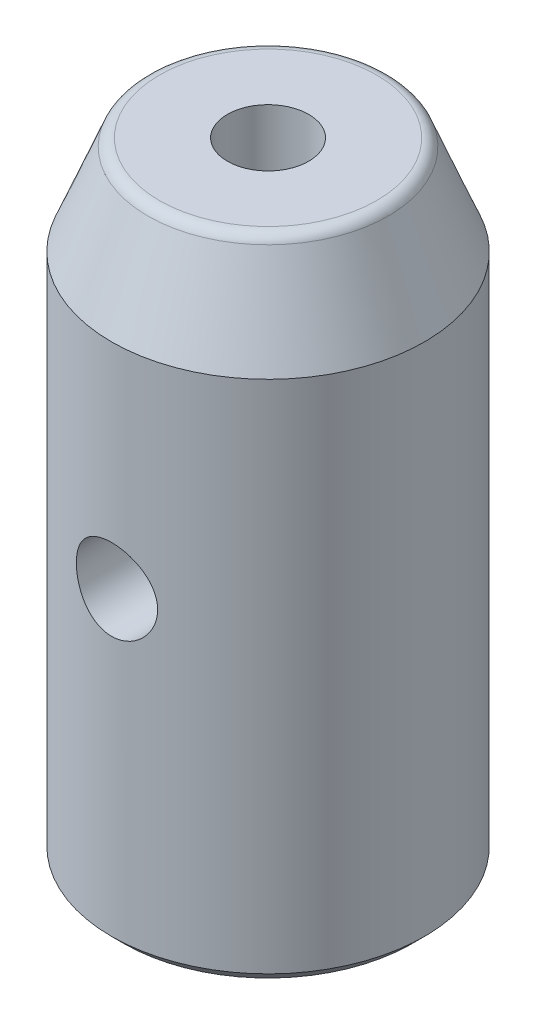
ISO-10303-21;
HEADER;
FILE_DESCRIPTION(('STEP AP214'),'2;1');
FILE_NAME('part.step','',(''),(''),'','','');
FILE_SCHEMA(('AUTOMOTIVE_DESIGN { 1 0 10303 214 1 1 1 1 }'));
ENDSEC;
DATA;
#1=APPLICATION_CONTEXT('core data for automotive mechanical design processes');
#2=APPLICATION_PROTOCOL_DEFINITION('international standard','automotive_design',2000,#1);
#3=PRODUCT_CONTEXT('',#1,'mechanical');
#4=PRODUCT('Part','Part','',(#3));
#5=PRODUCT_RELATED_PRODUCT_CATEGORY('part','',(#4));
#6=PRODUCT_DEFINITION_FORMATION('','',#4);
#7=PRODUCT_DEFINITION_CONTEXT('part definition',#1,'design');
#8=PRODUCT_DEFINITION('design','',#6,#7);
#9=PRODUCT_DEFINITION_SHAPE('','',#8);
#10=(LENGTH_UNIT() NAMED_UNIT(*) SI_UNIT(.MILLI.,.METRE.));
#11=(NAMED_UNIT(*) PLANE_ANGLE_UNIT() SI_UNIT($,.RADIAN.));
#12=(NAMED_UNIT(*) SI_UNIT($,.STERADIAN.) SOLID_ANGLE_UNIT());
#13=UNCERTAINTY_MEASURE_WITH_UNIT(LENGTH_MEASURE(1.E-05),#10,'distance_accuracy_value','');
#14=(GEOMETRIC_REPRESENTATION_CONTEXT(3) GLOBAL_UNCERTAINTY_ASSIGNED_CONTEXT((#13)) GLOBAL_UNIT_ASSIGNED_CONTEXT((#10,
#11,#12)) REPRESENTATION_CONTEXT('',''));
#15=CARTESIAN_POINT('',(0.,0.,0.));
#16=DIRECTION('',(0.,0.,1.));
#17=DIRECTION('',(1.,0.,0.));
#18=AXIS2_PLACEMENT_3D('',#15,#16,#17);
#19=CARTESIAN_POINT('',(0.,25.4,0.));
#20=DIRECTION('',(0.,-1.,0.));
#21=DIRECTION('',(0.,0.,-1.));
#22=AXIS2_PLACEMENT_3D('',#19,#20,#21);
#23=CYLINDRICAL_SURFACE('',#22,6.35);
#24=CARTESIAN_POINT('',(0.,14.35,-6.35));
#25=CARTESIAN_POINT('',(-0.0910448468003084,14.3499976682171,-6.34999855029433));
#26=CARTESIAN_POINT('',(-0.182115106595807,14.3424390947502,-6.34802256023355));
#27=CARTESIAN_POINT('',(-0.361637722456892,14.312454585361,-6.34033166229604));
#28=CARTESIAN_POINT('',(-0.450088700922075,14.290020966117,-6.33461482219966));
#29=CARTESIAN_POINT('',(-0.621755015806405,14.2310607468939,-6.32007407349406));
#30=CARTESIAN_POINT('',(-0.704976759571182,14.1945518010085,-6.3112540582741));
#31=CARTESIAN_POINT('',(-0.864115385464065,14.1085413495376,-6.29144207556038));
#32=CARTESIAN_POINT('',(-0.940031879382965,14.0590391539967,-6.28044999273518));
#33=CARTESIAN_POINT('',(-1.08408361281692,13.9472915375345,-6.25721162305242));
#34=CARTESIAN_POINT('',(-1.1520343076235,13.8848124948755,-6.2449447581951));
#35=CARTESIAN_POINT('',(-1.27662045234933,13.7493844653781,-6.22067339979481));
#36=CARTESIAN_POINT('',(-1.33325452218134,13.6764342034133,-6.20866893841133));
#37=CARTESIAN_POINT('',(-1.43448627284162,13.5206782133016,-6.18607236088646));
#38=CARTESIAN_POINT('',(-1.47887409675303,13.4377319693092,-6.17550627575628));
#39=CARTESIAN_POINT('',(-1.55300255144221,13.2652354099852,-6.15728432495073));
#40=CARTESIAN_POINT('',(-1.58274573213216,13.1756862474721,-6.14962795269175));
#41=CARTESIAN_POINT('',(-1.62610440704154,12.9945636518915,-6.13830437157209));
#42=CARTESIAN_POINT('',(-1.6400533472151,12.9030753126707,-6.13455482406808));
#43=CARTESIAN_POINT('',(-1.65246676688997,12.7189861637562,-6.13122323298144));
#44=CARTESIAN_POINT('',(-1.65093398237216,12.6263855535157,-6.13164045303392));
#45=CARTESIAN_POINT('',(-1.63269273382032,12.4452833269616,-6.13652142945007));
#46=CARTESIAN_POINT('',(-1.61638516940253,12.3567379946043,-6.14087828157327));
#47=CARTESIAN_POINT('',(-1.56969829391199,12.1836852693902,-6.15297677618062));
#48=CARTESIAN_POINT('',(-1.53931790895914,12.0991781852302,-6.16071867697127));
#49=CARTESIAN_POINT('',(-1.46501490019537,11.935543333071,-6.17881066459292));
#50=CARTESIAN_POINT('',(-1.42094967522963,11.8564834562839,-6.18918799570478));
#51=CARTESIAN_POINT('',(-1.32062741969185,11.7067381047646,-6.2113666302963));
#52=CARTESIAN_POINT('',(-1.26436809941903,11.6360542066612,-6.22316820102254));
#53=CARTESIAN_POINT('',(-1.13919365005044,11.5027738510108,-6.2473127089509));
#54=CARTESIAN_POINT('',(-1.06994116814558,11.440494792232,-6.2596611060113));
#55=CARTESIAN_POINT('',(-0.921825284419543,11.3283711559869,-6.28318013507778));
#56=CARTESIAN_POINT('',(-0.842961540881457,11.2785270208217,-6.294350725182));
#57=CARTESIAN_POINT('',(-0.677386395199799,11.1925581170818,-6.31431860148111));
#58=CARTESIAN_POINT('',(-0.590645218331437,11.1564883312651,-6.32310633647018));
#59=CARTESIAN_POINT('',(-0.412050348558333,11.0995330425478,-6.33724917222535));
#60=CARTESIAN_POINT('',(-0.320197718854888,11.0786443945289,-6.34260498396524));
#61=CARTESIAN_POINT('',(-0.136698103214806,11.0531370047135,-6.34917395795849));
#62=CARTESIAN_POINT('',(-0.0451149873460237,11.0480864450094,-6.35049704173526));
#63=CARTESIAN_POINT('',(0.137588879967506,11.053209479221,-6.34916628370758));
#64=CARTESIAN_POINT('',(0.228709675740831,11.0633815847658,-6.34651283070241));
#65=CARTESIAN_POINT('',(0.406378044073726,11.0983062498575,-6.33759791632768));
#66=CARTESIAN_POINT('',(0.492975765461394,11.1228201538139,-6.33139554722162));
#67=CARTESIAN_POINT('',(0.660823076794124,11.185457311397,-6.31608436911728));
#68=CARTESIAN_POINT('',(0.742072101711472,11.2235820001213,-6.30697525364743));
#69=CARTESIAN_POINT('',(0.898610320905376,11.3131743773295,-6.28660102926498));
#70=CARTESIAN_POINT('',(0.973758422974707,11.3648798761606,-6.27529854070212));
#71=CARTESIAN_POINT('',(1.11446374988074,11.4798651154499,-6.25184511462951));
#72=CARTESIAN_POINT('',(1.18001917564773,11.5431470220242,-6.23969401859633));
#73=CARTESIAN_POINT('',(1.30148131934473,11.6814998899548,-6.21551205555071));
#74=CARTESIAN_POINT('',(1.3570840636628,11.7568402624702,-6.20349303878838));
#75=CARTESIAN_POINT('',(1.45486120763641,11.9160338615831,-6.18129455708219));
#76=CARTESIAN_POINT('',(1.49703618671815,11.9998867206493,-6.17111501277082));
#77=CARTESIAN_POINT('',(1.56644342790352,12.1732909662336,-6.1538633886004));
#78=CARTESIAN_POINT('',(1.59376344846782,12.2628053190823,-6.14677310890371));
#79=CARTESIAN_POINT('',(1.63290364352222,12.4453713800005,-6.13649272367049));
#80=CARTESIAN_POINT('',(1.64472753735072,12.5384222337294,-6.13330168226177));
#81=CARTESIAN_POINT('',(1.65233394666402,12.7223158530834,-6.13125643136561));
#82=CARTESIAN_POINT('',(1.64860385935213,12.8131373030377,-6.13227044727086));
#83=CARTESIAN_POINT('',(1.62633248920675,12.9928083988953,-6.13821413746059));
#84=CARTESIAN_POINT('',(1.60779155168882,13.0816580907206,-6.14314372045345));
#85=CARTESIAN_POINT('',(1.55670066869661,13.2542849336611,-6.15628671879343));
#86=CARTESIAN_POINT('',(1.52424906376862,13.3380930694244,-6.16447705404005));
#87=CARTESIAN_POINT('',(1.44633487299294,13.4991372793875,-6.18322034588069));
#88=CARTESIAN_POINT('',(1.40087034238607,13.5763723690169,-6.1937736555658));
#89=CARTESIAN_POINT('',(1.2967225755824,13.7244165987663,-6.2164235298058));
#90=CARTESIAN_POINT('',(1.23770439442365,13.7949847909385,-6.22855507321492));
#91=CARTESIAN_POINT('',(1.10876820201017,13.9253743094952,-6.25279366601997));
#92=CARTESIAN_POINT('',(1.03884757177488,13.9851930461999,-6.26490070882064));
#93=CARTESIAN_POINT('',(0.888403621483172,14.0935578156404,-6.28801547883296));
#94=CARTESIAN_POINT('',(0.807696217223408,14.1418544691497,-6.29899637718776));
#95=CARTESIAN_POINT('',(0.639026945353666,14.2241179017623,-6.31833266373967));
#96=CARTESIAN_POINT('',(0.551070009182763,14.2580943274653,-6.32668981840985));
#97=CARTESIAN_POINT('',(0.386139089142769,14.3060647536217,-6.33869137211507));
#98=CARTESIAN_POINT('',(0.309908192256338,14.3225033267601,-6.3429019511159));
#99=CARTESIAN_POINT('',(0.15579096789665,14.3444714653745,-6.34855676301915));
#100=CARTESIAN_POINT('',(0.0779047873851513,14.350001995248,-6.35000124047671));
#101=CARTESIAN_POINT('',(0.,14.35,-6.35));
#102=B_SPLINE_CURVE_WITH_KNOTS('',3,(#24,#25,#26,#27,#28,#29,#30,#31,#32,#33,#34,#35,#36,#37,
#38,#39,#40,#41,#42,#43,#44,#45,#46,#47,#48,#49,#50,#51,#52,#53,#54,#55,#56,#57,#58,#59,#60,#61,
#62,#63,#64,#65,#66,#67,#68,#69,#70,#71,#72,#73,#74,#75,#76,#77,#78,#79,#80,#81,#82,#83,#84,#85,
#86,#87,#88,#89,#90,#91,#92,#93,#94,#95,#96,#97,#98,#99,#100,#101),.UNSPECIFIED.,.T.,.F.,(4,2,2,
2,2,2,2,2,2,2,2,2,2,2,2,2,2,2,2,2,2,2,2,2,2,2,2,2,2,2,2,2,2,2,2,2,2,2,4),(0.,0.27284892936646,
0.545838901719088,0.818487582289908,1.09115074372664,1.36923066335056,1.64734447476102,
1.92996381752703,2.21253393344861,2.48902023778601,2.76545768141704,3.03461179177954,
3.30378644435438,3.57586585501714,3.847996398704,4.1285359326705,4.40908544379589,
4.69074339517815,4.97234297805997,5.24619498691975,5.52002022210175,5.7894134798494,
6.05883515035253,6.33333182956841,6.60787992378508,6.88975050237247,7.17160891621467,
7.45178358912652,7.73189100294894,8.00328805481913,8.27467877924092,8.54418177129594,
8.81372506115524,9.09082731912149,9.3679962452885,9.65070850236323,9.93323000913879,
10.1667206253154,10.4001905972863),.UNSPECIFIED.);
#103=CARTESIAN_POINT('',(0.,14.35,-6.35));
#104=VERTEX_POINT('',#103);
#105=EDGE_CURVE('E73',#104,#104,#102,.T.);
#106=ORIENTED_EDGE('',*,*,#105,.T.);
#107=EDGE_LOOP('',(#106));
#108=FACE_BOUND('',#107,.T.);
#109=CARTESIAN_POINT('',(1.65,12.7,6.13188388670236));
#110=CARTESIAN_POINT('',(1.64999763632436,12.6090136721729,6.13188553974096));
#111=CARTESIAN_POINT('',(1.64244844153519,12.5180018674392,6.1339311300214));
#112=CARTESIAN_POINT('',(1.61250455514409,12.3386004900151,6.14186949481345));
#113=CARTESIAN_POINT('',(1.5901019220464,12.2502123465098,6.14776432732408));
#114=CARTESIAN_POINT('',(1.53123224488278,12.0786793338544,6.16268948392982));
#115=CARTESIAN_POINT('',(1.49478429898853,11.9955275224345,6.17171554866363));
#116=CARTESIAN_POINT('',(1.40891777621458,11.8365074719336,6.19188078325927));
#117=CARTESIAN_POINT('',(1.35949838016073,11.760639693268,6.20302008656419));
#118=CARTESIAN_POINT('',(1.24783688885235,11.61653888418,6.22645310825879));
#119=CARTESIAN_POINT('',(1.18534252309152,11.5485044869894,6.23876646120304));
#120=CARTESIAN_POINT('',(1.04984797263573,11.4237551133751,6.26299035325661));
#121=CARTESIAN_POINT('',(0.976846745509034,11.3670412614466,6.27490085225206));
#122=CARTESIAN_POINT('',(0.821040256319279,11.2657210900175,6.29719537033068));
#123=CARTESIAN_POINT('',(0.738103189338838,11.2213112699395,6.30755352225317));
#124=CARTESIAN_POINT('',(0.565626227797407,11.1471396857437,6.3253515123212));
#125=CARTESIAN_POINT('',(0.476087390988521,11.1173755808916,6.33279181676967));
#126=CARTESIAN_POINT('',(0.295020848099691,11.0739804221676,6.34377696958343));
#127=CARTESIAN_POINT('',(0.203579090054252,11.0600117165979,6.34740322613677));
#128=CARTESIAN_POINT('',(0.0195829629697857,11.0475425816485,6.35063594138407));
#129=CARTESIAN_POINT('',(-0.0729712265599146,11.0490396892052,6.35024304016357));
#130=CARTESIAN_POINT('',(-0.254218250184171,11.0672197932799,6.34554175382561));
#131=CARTESIAN_POINT('',(-0.342950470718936,11.0835381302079,6.34132739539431));
#132=CARTESIAN_POINT('',(-0.516371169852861,11.1303095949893,6.32956706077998));
#133=CARTESIAN_POINT('',(-0.601059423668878,11.1607635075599,6.32202089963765));
#134=CARTESIAN_POINT('',(-0.764931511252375,11.2352275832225,6.30430356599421));
#135=CARTESIAN_POINT('',(-0.844054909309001,11.2793646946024,6.29410796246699));
#136=CARTESIAN_POINT('',(-0.99389783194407,11.379845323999,6.27219339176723));
#137=CARTESIAN_POINT('',(-1.06461578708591,11.4361911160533,6.26047414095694));
#138=CARTESIAN_POINT('',(-1.1978163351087,11.5614334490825,6.23638166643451));
#139=CARTESIAN_POINT('',(-1.25999831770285,11.630648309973,6.22399933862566));
#140=CARTESIAN_POINT('',(-1.37194316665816,11.7786523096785,6.20028671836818));
#141=CARTESIAN_POINT('',(-1.42170535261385,11.8574419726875,6.18895648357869));
#142=CARTESIAN_POINT('',(-1.50761156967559,12.022984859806,6.16859596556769));
#143=CARTESIAN_POINT('',(-1.54367780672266,12.1097801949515,6.15957891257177));
#144=CARTESIAN_POINT('',(-1.60061006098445,12.2884943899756,6.14503216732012));
#145=CARTESIAN_POINT('',(-1.62147963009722,12.38041204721,6.139501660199));
#146=CARTESIAN_POINT('',(-1.64691605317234,12.5639600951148,6.13272673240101));
#147=CARTESIAN_POINT('',(-1.65192968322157,12.6555243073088,6.13136488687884));
#148=CARTESIAN_POINT('',(-1.6467396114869,12.8381820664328,6.13276088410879));
#149=CARTESIAN_POINT('',(-1.63653743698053,12.92927565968,6.13551831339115));
#150=CARTESIAN_POINT('',(-1.60159835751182,13.1067111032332,6.14472911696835));
#151=CARTESIAN_POINT('',(-1.57712648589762,13.1931089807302,6.15111504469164));
#152=CARTESIAN_POINT('',(-1.51463894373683,13.3605749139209,6.16679819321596));
#153=CARTESIAN_POINT('',(-1.47662157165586,13.4416422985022,6.17609577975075));
#154=CARTESIAN_POINT('',(-1.38720350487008,13.5980251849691,6.19679824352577));
#155=CARTESIAN_POINT('',(-1.33553846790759,13.6731841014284,6.20824328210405));
#156=CARTESIAN_POINT('',(-1.22062204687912,13.8139295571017,6.23185492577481));
#157=CARTESIAN_POINT('',(-1.15736859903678,13.8795143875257,6.24402165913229));
#158=CARTESIAN_POINT('',(-1.0190110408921,14.0010858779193,6.26810744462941));
#159=CARTESIAN_POINT('',(-0.94363079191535,14.0567620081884,6.28001069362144));
#160=CARTESIAN_POINT('',(-0.784333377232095,14.1546682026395,6.3018866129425));
#161=CARTESIAN_POINT('',(-0.700416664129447,14.1968989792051,6.31185938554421));
#162=CARTESIAN_POINT('',(-0.527016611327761,14.2663359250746,6.3286868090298));
#163=CARTESIAN_POINT('',(-0.437579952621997,14.2936528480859,6.33556437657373));
#164=CARTESIAN_POINT('',(-0.255181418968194,14.3328129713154,6.34552712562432));
#165=CARTESIAN_POINT('',(-0.162220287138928,14.3446594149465,6.34861310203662));
#166=CARTESIAN_POINT('',(0.0216806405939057,14.3523476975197,6.35060954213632));
#167=CARTESIAN_POINT('',(0.112600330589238,14.348646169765,6.34963914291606));
#168=CARTESIAN_POINT('',(0.292475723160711,14.326397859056,6.34389911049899));
#169=CARTESIAN_POINT('',(0.381431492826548,14.3078515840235,6.33912960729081));
#170=CARTESIAN_POINT('',(0.554334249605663,14.2566930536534,6.32634877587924));
#171=CARTESIAN_POINT('',(0.638309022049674,14.2241692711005,6.31835785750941));
#172=CARTESIAN_POINT('',(0.799657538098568,14.1460583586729,6.29997214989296));
#173=CARTESIAN_POINT('',(0.877030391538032,14.100469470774,6.2895770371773));
#174=CARTESIAN_POINT('',(1.025121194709,13.9961626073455,6.26716709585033));
#175=CARTESIAN_POINT('',(1.09561856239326,13.9371389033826,6.25511766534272));
#176=CARTESIAN_POINT('',(1.22586275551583,13.8082234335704,6.23090349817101));
#177=CARTESIAN_POINT('',(1.28560679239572,13.7383288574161,6.21873873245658));
#178=CARTESIAN_POINT('',(1.39386165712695,13.5879245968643,6.19538429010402));
#179=CARTESIAN_POINT('',(1.44211599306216,13.5072260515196,6.18421983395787));
#180=CARTESIAN_POINT('',(1.52430254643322,13.3385820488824,6.16447892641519));
#181=CARTESIAN_POINT('',(1.55824457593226,13.250641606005,6.15590070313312));
#182=CARTESIAN_POINT('',(1.60614388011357,13.0857937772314,6.14355741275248));
#183=CARTESIAN_POINT('',(1.62255248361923,13.0096329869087,6.13921421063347));
#184=CARTESIAN_POINT('',(1.64448100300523,12.8556542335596,6.13337688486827));
#185=CARTESIAN_POINT('',(1.6500020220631,12.7778364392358,6.13188247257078));
#186=CARTESIAN_POINT('',(1.65,12.7,6.13188388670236));
#187=B_SPLINE_CURVE_WITH_KNOTS('',3,(#109,#110,#111,#112,#113,#114,#115,#116,#117,#118,#119,
#120,#121,#122,#123,#124,#125,#126,#127,#128,#129,#130,#131,#132,#133,#134,#135,#136,#137,#138,
#139,#140,#141,#142,#143,#144,#145,#146,#147,#148,#149,#150,#151,#152,#153,#154,#155,#156,#157,
#158,#159,#160,#161,#162,#163,#164,#165,#166,#167,#168,#169,#170,#171,#172,#173,#174,#175,#176,
#177,#178,#179,#180,#181,#182,#183,#184,#185,#186),.UNSPECIFIED.,.T.,.F.,(4,2,2,2,2,2,2,2,2,2,2,
2,2,2,2,2,2,2,2,2,2,2,2,2,2,2,2,2,2,2,2,2,2,2,2,2,2,2,4),(0.,0.272672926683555,
0.545491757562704,0.817940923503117,1.09040729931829,1.36871710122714,1.64705453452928,
1.92960985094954,2.21211999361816,2.48846958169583,2.76477515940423,3.03446142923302,
3.30416267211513,3.57644504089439,3.84877816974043,4.12905991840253,4.40935701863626,
4.69122322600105,4.97302353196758,5.24680930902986,5.52056760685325,5.78939636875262,
6.05825891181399,6.33276889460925,6.60732781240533,6.88937426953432,7.1714057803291,
7.45131334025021,7.73116220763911,8.00285046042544,8.27452941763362,8.54451349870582,
8.8145339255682,9.09145439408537,9.36844657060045,9.65113942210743,9.9336381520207,
10.1669263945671,10.400190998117),.UNSPECIFIED.);
#188=CARTESIAN_POINT('',(1.65,12.7,6.13188388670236));
#189=VERTEX_POINT('',#188);
#190=EDGE_CURVE('E79',#189,#189,#187,.T.);
#191=ORIENTED_EDGE('',*,*,#190,.T.);
#192=EDGE_LOOP('',(#191));
#193=FACE_BOUND('',#192,.T.);
#194=CARTESIAN_POINT('',(0.,0.5,0.));
#195=DIRECTION('',(0.,1.,0.));
#196=DIRECTION('',(0.,0.,1.));
#197=AXIS2_PLACEMENT_3D('',#194,#195,#196);
#198=CIRCLE('',#197,6.35);
#199=CARTESIAN_POINT('',(0.,0.5,6.35));
#200=VERTEX_POINT('',#199);
#201=EDGE_CURVE('E46',#200,#200,#198,.T.);
#202=ORIENTED_EDGE('',*,*,#201,.T.);
#203=EDGE_LOOP('',(#202));
#204=FACE_BOUND('',#203,.T.);
#205=CARTESIAN_POINT('',(0.,21.4,0.));
#206=DIRECTION('',(0.,1.,0.));
#207=DIRECTION('',(0.,0.,1.));
#208=AXIS2_PLACEMENT_3D('',#205,#206,#207);
#209=CIRCLE('',#208,6.35);
#210=CARTESIAN_POINT('',(0.,21.4,6.35));
#211=VERTEX_POINT('',#210);
#212=EDGE_CURVE('E58',#211,#211,#209,.F.);
#213=ORIENTED_EDGE('',*,*,#212,.T.);
#214=EDGE_LOOP('',(#213));
#215=FACE_BOUND('',#214,.T.);
#216=ADVANCED_FACE('F34',(#108,#193,#204,#215),#23,.T.);
#217=CARTESIAN_POINT('',(0.,25.4,0.));
#218=DIRECTION('',(0.,1.,0.));
#219=DIRECTION('',(0.,0.,1.));
#220=AXIS2_PLACEMENT_3D('',#217,#218,#219);
#221=PLANE('',#220);
#222=CARTESIAN_POINT('',(0.,25.4,0.));
#223=DIRECTION('',(0.,1.,0.));
#224=DIRECTION('',(0.,0.,1.));
#225=AXIS2_PLACEMENT_3D('',#222,#223,#224);
#226=CIRCLE('',#225,4.41148351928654);
#227=CARTESIAN_POINT('',(0.,25.4,4.41148351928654));
#228=VERTEX_POINT('',#227);
#229=EDGE_CURVE('E55',#228,#228,#226,.T.);
#230=ORIENTED_EDGE('',*,*,#229,.T.);
#231=EDGE_LOOP('',(#230));
#232=FACE_BOUND('',#231,.T.);
#233=CARTESIAN_POINT('',(0.,25.4,0.));
#234=DIRECTION('',(0.,1.,0.));
#235=DIRECTION('',(0.,0.,1.));
#236=AXIS2_PLACEMENT_3D('',#233,#234,#235);
#237=CIRCLE('',#236,1.65);
#238=CARTESIAN_POINT('',(0.,25.4,1.65));
#239=VERTEX_POINT('',#238);
#240=EDGE_CURVE('E64',#239,#239,#237,.T.);
#241=ORIENTED_EDGE('',*,*,#240,.F.);
#242=EDGE_LOOP('',(#241));
#243=FACE_BOUND('',#242,.T.);
#244=ADVANCED_FACE('F108',(#232,#243),#221,.T.);
#245=CARTESIAN_POINT('',(0.,0.,0.));
#246=DIRECTION('',(0.,1.,0.));
#247=DIRECTION('',(0.,0.,1.));
#248=AXIS2_PLACEMENT_3D('',#245,#246,#247);
#249=PLANE('',#248);
#250=CARTESIAN_POINT('',(0.,0.,0.));
#251=DIRECTION('',(0.,1.,0.));
#252=DIRECTION('',(0.,0.,1.));
#253=AXIS2_PLACEMENT_3D('',#250,#251,#252);
#254=CIRCLE('',#253,5.85);
#255=CARTESIAN_POINT('',(0.,0.,5.85));
#256=VERTEX_POINT('',#255);
#257=EDGE_CURVE('E10',#256,#256,#254,.F.);
#258=ORIENTED_EDGE('',*,*,#257,.T.);
#259=EDGE_LOOP('',(#258));
#260=FACE_BOUND('',#259,.T.);
#261=CARTESIAN_POINT('',(0.,0.,0.));
#262=DIRECTION('',(0.,-1.,0.));
#263=DIRECTION('',(0.,0.,-1.));
#264=AXIS2_PLACEMENT_3D('',#261,#262,#263);
#265=CIRCLE('',#264,2.5);
#266=CARTESIAN_POINT('',(0.,0.,-2.5));
#267=VERTEX_POINT('',#266);
#268=EDGE_CURVE('E70',#267,#267,#265,.T.);
#269=ORIENTED_EDGE('',*,*,#268,.F.);
#270=EDGE_LOOP('',(#269));
#271=FACE_BOUND('',#270,.T.);
#272=ADVANCED_FACE('F106',(#260,#271),#249,.F.);
#273=CARTESIAN_POINT('',(0.,15.3,0.));
#274=DIRECTION('',(0.,1.,0.));
#275=DIRECTION('',(0.,0.,1.));
#276=AXIS2_PLACEMENT_3D('',#273,#274,#275);
#277=CONICAL_SURFACE('',#276,1.65,1.02974425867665);
#278=CARTESIAN_POINT('',(-0.0573261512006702,14.3490038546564,-0.0352116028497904));
#279=CARTESIAN_POINT('',(-0.0554022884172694,14.349070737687,-0.038556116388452));
#280=CARTESIAN_POINT('',(-0.0531981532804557,14.3491440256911,-0.0417422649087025));
#281=CARTESIAN_POINT('',(-0.0482828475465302,14.3492952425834,-0.0477003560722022));
#282=CARTESIAN_POINT('',(-0.0455711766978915,14.3493731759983,-0.0504718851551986));
#283=CARTESIAN_POINT('',(-0.0397197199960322,14.3495244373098,-0.0555035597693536));
#284=CARTESIAN_POINT('',(-0.0365810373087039,14.349597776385,-0.0577649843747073));
#285=CARTESIAN_POINT('',(-0.0299586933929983,14.3497313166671,-0.0617075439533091));
#286=CARTESIAN_POINT('',(-0.0264751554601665,14.3497915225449,-0.0633888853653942));
#287=CARTESIAN_POINT('',(-0.0193829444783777,14.3498898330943,-0.066067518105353));
#288=CARTESIAN_POINT('',(-0.0157819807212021,14.3499285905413,-0.0670852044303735));
#289=CARTESIAN_POINT('',(-0.00845849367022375,14.3499823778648,-0.0684855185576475));
#290=CARTESIAN_POINT('',(-0.00473598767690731,14.3499974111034,-0.0688682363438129));
#291=CARTESIAN_POINT('',(0.00263034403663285,14.3500019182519,-0.0689835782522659));
#292=CARTESIAN_POINT('',(0.00627394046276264,14.3499919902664,-0.068731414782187));
#293=CARTESIAN_POINT('',(0.0134664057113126,14.3499489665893,-0.067617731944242));
#294=CARTESIAN_POINT('',(0.0170152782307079,14.3499158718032,-0.0667562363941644));
#295=CARTESIAN_POINT('',(0.0239114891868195,14.3498303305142,-0.0644556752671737));
#296=CARTESIAN_POINT('',(0.0272592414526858,14.3497779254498,-0.0630178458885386));
#297=CARTESIAN_POINT('',(0.0336722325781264,14.349659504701,-0.0596113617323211));
#298=CARTESIAN_POINT('',(0.0367374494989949,14.3495934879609,-0.0576426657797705));
#299=CARTESIAN_POINT('',(0.0425655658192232,14.3494535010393,-0.0531908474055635));
#300=CARTESIAN_POINT('',(0.0453212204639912,14.3493793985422,-0.0506982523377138));
#301=CARTESIAN_POINT('',(0.0503905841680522,14.349232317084,-0.0452983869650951));
#302=CARTESIAN_POINT('',(0.0527042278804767,14.3491593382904,-0.0423910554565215));
#303=CARTESIAN_POINT('',(0.0569012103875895,14.3490199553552,-0.0361466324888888));
#304=CARTESIAN_POINT('',(0.0587687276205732,14.3489538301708,-0.0327989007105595));
#305=CARTESIAN_POINT('',(0.0619336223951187,14.3488379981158,-0.0258437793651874));
#306=CARTESIAN_POINT('',(0.0632309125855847,14.3487882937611,-0.0222363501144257));
#307=CARTESIAN_POINT('',(0.065255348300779,14.3487094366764,-0.0147526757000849));
#308=CARTESIAN_POINT('',(0.0659649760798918,14.3486809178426,-0.0108716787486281));
#309=CARTESIAN_POINT('',(0.0667340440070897,14.3486499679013,-0.00304555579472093));
#310=CARTESIAN_POINT('',(0.0667934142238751,14.3486475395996,0.000899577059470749));
#311=CARTESIAN_POINT('',(0.0662563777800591,14.3486692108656,0.00880601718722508));
#312=CARTESIAN_POINT('',(0.0656498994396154,14.3486937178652,0.0127666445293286));
#313=CARTESIAN_POINT('',(0.0637790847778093,14.348767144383,0.0205294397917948));
#314=CARTESIAN_POINT('',(0.0625147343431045,14.3488160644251,0.0243316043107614));
#315=CARTESIAN_POINT('',(0.0593636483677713,14.3489325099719,0.031653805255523));
#316=CARTESIAN_POINT('',(0.0574789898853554,14.3489999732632,0.0351747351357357));
#317=CARTESIAN_POINT('',(0.0531330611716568,14.3491457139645,0.0418408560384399));
#318=CARTESIAN_POINT('',(0.0506718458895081,14.3492239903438,0.0449860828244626));
#319=CARTESIAN_POINT('',(0.0452966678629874,14.3493802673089,0.0507363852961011));
#320=CARTESIAN_POINT('',(0.0423935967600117,14.3494582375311,0.0533516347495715));
#321=CARTESIAN_POINT('',(0.0361768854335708,14.3496062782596,0.058038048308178));
#322=CARTESIAN_POINT('',(0.0328633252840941,14.3496763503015,0.0601093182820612));
#323=CARTESIAN_POINT('',(0.0260345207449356,14.3497980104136,0.0635776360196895));
#324=CARTESIAN_POINT('',(0.0225292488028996,14.3498501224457,0.0649943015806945));
#325=CARTESIAN_POINT('',(0.0153262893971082,14.3499327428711,0.0671998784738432));
#326=CARTESIAN_POINT('',(0.0116286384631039,14.3499632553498,0.0679889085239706));
#327=CARTESIAN_POINT('',(0.00425845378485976,14.3499985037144,0.0688976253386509));
#328=CARTESIAN_POINT('',(0.000588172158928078,14.3500039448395,0.0690356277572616));
#329=CARTESIAN_POINT('',(-0.00672239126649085,14.3499903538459,0.0686873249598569));
#330=CARTESIAN_POINT('',(-0.0103626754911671,14.3499713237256,0.0682010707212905));
#331=CARTESIAN_POINT('',(-0.017474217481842,14.3499112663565,0.0666289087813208));
#332=CARTESIAN_POINT('',(-0.0209467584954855,14.3498704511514,0.0655487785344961));
#333=CARTESIAN_POINT('',(-0.0276647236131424,14.3497714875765,0.0628288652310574));
#334=CARTESIAN_POINT('',(-0.0309101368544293,14.3497133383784,0.0611890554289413));
#335=CARTESIAN_POINT('',(-0.0371317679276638,14.3495851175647,0.0573756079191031));
#336=CARTESIAN_POINT('',(-0.0401036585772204,14.3495148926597,0.0551949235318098));
#337=CARTESIAN_POINT('',(-0.0456522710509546,14.3493706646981,0.050378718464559));
#338=CARTESIAN_POINT('',(-0.048228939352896,14.3492966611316,0.0477431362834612));
#339=CARTESIAN_POINT('',(-0.0529952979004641,14.3491504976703,0.0420098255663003));
#340=CARTESIAN_POINT('',(-0.0551713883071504,14.3490784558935,0.0389007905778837));
#341=CARTESIAN_POINT('',(-0.0589892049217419,14.3489463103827,0.0323703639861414));
#342=CARTESIAN_POINT('',(-0.0606308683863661,14.3488862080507,0.028948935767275));
#343=CARTESIAN_POINT('',(-0.063385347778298,14.3487826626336,0.0217771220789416));
#344=CARTESIAN_POINT('',(-0.0644802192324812,14.3487397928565,0.0180198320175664));
#345=CARTESIAN_POINT('',(-0.0660384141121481,14.3486781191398,0.0103751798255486));
#346=CARTESIAN_POINT('',(-0.0665015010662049,14.3486593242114,0.00648776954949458));
#347=CARTESIAN_POINT('',(-0.0667883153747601,14.3486477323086,-0.00139174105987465));
#348=CARTESIAN_POINT('',(-0.0665985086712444,14.3486554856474,-0.00538433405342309));
#349=CARTESIAN_POINT('',(-0.0655536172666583,14.3486973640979,-0.0132782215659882));
#350=CARTESIAN_POINT('',(-0.0646992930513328,14.3487314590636,-0.0171796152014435));
#351=CARTESIAN_POINT('',(-0.0627577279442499,14.34880624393,-0.0234565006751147));
#352=CARTESIAN_POINT('',(-0.0618549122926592,14.3488405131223,-0.0258906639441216));
#353=CARTESIAN_POINT('',(-0.0597856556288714,14.3489168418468,-0.0306442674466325));
#354=CARTESIAN_POINT('',(-0.058619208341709,14.3489589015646,-0.0329637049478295));
#355=CARTESIAN_POINT('',(-0.0573261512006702,14.3490038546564,-0.0352116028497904));
#356=B_SPLINE_CURVE_WITH_KNOTS('',3,(#278,#279,#280,#281,#282,#283,#284,#285,#286,#287,#288,
#289,#290,#291,#292,#293,#294,#295,#296,#297,#298,#299,#300,#301,#302,#303,#304,#305,#306,#307,
#308,#309,#310,#311,#312,#313,#314,#315,#316,#317,#318,#319,#320,#321,#322,#323,#324,#325,#326,
#327,#328,#329,#330,#331,#332,#333,#334,#335,#336,#337,#338,#339,#340,#341,#342,#343,#344,#345,
#346,#347,#348,#349,#350,#351,#352,#353,#354,#355),.UNSPECIFIED.,.T.,.F.,(4,2,2,2,2,2,2,2,2,2,2,
2,2,2,2,2,2,2,2,2,2,2,2,2,2,2,2,2,2,2,2,2,2,2,2,2,2,2,4),(0.,0.0115675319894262,
0.0231465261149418,0.0346961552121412,0.0462416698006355,0.0574131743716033,0.0685830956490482,
0.0794879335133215,0.0903923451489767,0.101273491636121,0.112155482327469,0.123254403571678,
0.13435496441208,0.145804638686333,0.157256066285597,0.16903767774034,0.180820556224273,
0.19278414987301,0.204748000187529,0.21667219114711,0.228595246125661,0.240261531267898,
0.251925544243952,0.263212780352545,0.274497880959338,0.285463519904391,0.296428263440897,
0.307288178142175,0.318148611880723,0.329158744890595,0.340170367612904,0.35150564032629,
0.3628422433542,0.374529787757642,0.386221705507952,0.398157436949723,0.410079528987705,
0.41785405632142,0.42562876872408),.UNSPECIFIED.);
#357=CARTESIAN_POINT('',(-0.0573261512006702,14.3490038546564,-0.0352116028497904));
#358=VERTEX_POINT('',#357);
#359=EDGE_CURVE('E95',#358,#358,#356,.T.);
#360=ORIENTED_EDGE('',*,*,#359,.T.);
#361=EDGE_LOOP('',(#360));
#362=FACE_BOUND('',#361,.T.);
#363=CARTESIAN_POINT('',(0.,15.3,0.));
#364=DIRECTION('',(0.,1.,0.));
#365=DIRECTION('',(0.,0.,1.));
#366=AXIS2_PLACEMENT_3D('',#363,#364,#365);
#367=CIRCLE('',#366,1.65);
#368=CARTESIAN_POINT('',(0.,15.3,1.65));
#369=VERTEX_POINT('',#368);
#370=EDGE_CURVE('E61',#369,#369,#367,.T.);
#371=ORIENTED_EDGE('',*,*,#370,.T.);
#372=EDGE_LOOP('',(#371));
#373=FACE_BOUND('',#372,.T.);
#374=ADVANCED_FACE('F100',(#362,#373),#277,.F.);
#375=CARTESIAN_POINT('',(0.,25.4,0.));
#376=DIRECTION('',(0.,1.,0.));
#377=DIRECTION('',(0.,0.,1.));
#378=AXIS2_PLACEMENT_3D('',#375,#376,#377);
#379=CYLINDRICAL_SURFACE('',#378,1.65);
#380=ORIENTED_EDGE('',*,*,#370,.F.);
#381=EDGE_LOOP('',(#380));
#382=FACE_BOUND('',#381,.T.);
#383=ORIENTED_EDGE('',*,*,#240,.T.);
#384=EDGE_LOOP('',(#383));
#385=FACE_BOUND('',#384,.T.);
#386=ADVANCED_FACE('F105',(#382,#385),#379,.F.);
#387=CARTESIAN_POINT('',(0.,11.,0.));
#388=DIRECTION('',(0.,-1.,0.));
#389=DIRECTION('',(0.,0.,-1.));
#390=AXIS2_PLACEMENT_3D('',#387,#388,#389);
#391=CONICAL_SURFACE('',#390,2.5,1.02974425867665);
#392=CARTESIAN_POINT('',(-0.554018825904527,11.1457917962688,-2.18832013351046));
#393=CARTESIAN_POINT('',(-0.591707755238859,11.1592256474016,-2.15571586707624));
#394=CARTESIAN_POINT('',(-0.627256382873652,11.1734356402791,-2.12096487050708));
#395=CARTESIAN_POINT('',(-0.694527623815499,11.2028436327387,-2.04829371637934));
#396=CARTESIAN_POINT('',(-0.726244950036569,11.2180429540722,-2.01036929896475));
#397=CARTESIAN_POINT('',(-0.816643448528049,11.264648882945,-1.89262103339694));
#398=CARTESIAN_POINT('',(-0.87018531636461,11.2969130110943,-1.80918224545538));
#399=CARTESIAN_POINT('',(-0.958179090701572,11.3558722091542,-1.65108057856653));
#400=CARTESIAN_POINT('',(-0.994328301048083,11.3825852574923,-1.57732383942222));
#401=CARTESIAN_POINT('',(-1.06021246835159,11.4350007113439,-1.42657832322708));
#402=CARTESIAN_POINT('',(-1.0899426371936,11.4607023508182,-1.349587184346));
#403=CARTESIAN_POINT('',(-1.14363308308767,11.5100715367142,-1.19305680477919));
#404=CARTESIAN_POINT('',(-1.16759666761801,11.5337402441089,-1.11351905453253));
#405=CARTESIAN_POINT('',(-1.21018320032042,11.577993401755,-0.952196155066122));
#406=CARTESIAN_POINT('',(-1.22880700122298,11.5985783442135,-0.870411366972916));
#407=CARTESIAN_POINT('',(-1.26175078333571,11.6364450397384,-0.700469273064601));
#408=CARTESIAN_POINT('',(-1.27578965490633,11.653493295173,-0.612204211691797));
#409=CARTESIAN_POINT('',(-1.29815023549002,11.6813593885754,-0.433988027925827));
#410=CARTESIAN_POINT('',(-1.30647413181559,11.6921796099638,-0.34403756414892));
#411=CARTESIAN_POINT('',(-1.31730272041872,11.7063721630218,-0.163523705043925));
#412=CARTESIAN_POINT('',(-1.31982917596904,11.7097723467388,-0.0729638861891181));
#413=CARTESIAN_POINT('',(-1.31907983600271,11.7087738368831,0.108083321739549));
#414=CARTESIAN_POINT('',(-1.31580455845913,11.7043758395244,0.198570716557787));
#415=CARTESIAN_POINT('',(-1.30447558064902,11.689599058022,0.364380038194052));
#416=CARTESIAN_POINT('',(-1.29725052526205,11.6802647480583,0.439857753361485));
#417=CARTESIAN_POINT('',(-1.27876839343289,11.6571818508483,0.589628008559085));
#418=CARTESIAN_POINT('',(-1.26751115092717,11.6434330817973,0.663920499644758));
#419=CARTESIAN_POINT('',(-1.24090731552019,11.6123102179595,0.811367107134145));
#420=CARTESIAN_POINT('',(-1.22554148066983,11.5949191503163,0.884514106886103));
#421=CARTESIAN_POINT('',(-1.19065356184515,11.5574150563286,1.02910034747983));
#422=CARTESIAN_POINT('',(-1.1711311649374,11.5373018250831,1.10053945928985));
#423=CARTESIAN_POINT('',(-1.12864183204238,11.4960453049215,1.23845723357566));
#424=CARTESIAN_POINT('',(-1.10585915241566,11.474983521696,1.30501709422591));
#425=CARTESIAN_POINT('',(-1.05595921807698,11.4317171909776,1.43607733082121));
#426=CARTESIAN_POINT('',(-1.02884420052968,11.4095132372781,1.50057874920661));
#427=CARTESIAN_POINT('',(-0.969903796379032,11.3646523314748,1.62684418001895));
#428=CARTESIAN_POINT('',(-0.938100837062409,11.3419979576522,1.68861949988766));
#429=CARTESIAN_POINT('',(-0.869011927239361,11.2967806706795,1.80901920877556));
#430=CARTESIAN_POINT('',(-0.831731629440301,11.2742176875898,1.86764676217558));
#431=CARTESIAN_POINT('',(-0.758133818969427,11.2340008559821,1.97027928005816));
#432=CARTESIAN_POINT('',(-0.722892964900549,11.2162054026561,2.01499444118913));
#433=CARTESIAN_POINT('',(-0.647358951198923,11.1817270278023,2.10062270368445));
#434=CARTESIAN_POINT('',(-0.60705809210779,11.1650458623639,2.1415298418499));
#435=CARTESIAN_POINT('',(-0.52019017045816,11.1334525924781,2.21831631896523));
#436=CARTESIAN_POINT('',(-0.47354916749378,11.1185660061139,2.25412420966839));
#437=CARTESIAN_POINT('',(-0.374019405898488,11.0921350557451,2.31730220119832));
#438=CARTESIAN_POINT('',(-0.321155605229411,11.0805779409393,2.3447045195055));
#439=CARTESIAN_POINT('',(-0.230250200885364,11.0657516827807,2.37973883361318));
#440=CARTESIAN_POINT('',(-0.193830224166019,11.0609970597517,2.39093642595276));
#441=CARTESIAN_POINT('',(-0.119472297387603,11.0539090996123,2.4076105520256));
#442=CARTESIAN_POINT('',(-0.0815359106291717,11.0515733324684,2.41309282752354));
#443=CARTESIAN_POINT('',(-0.00506628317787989,11.0495632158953,2.41781150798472));
#444=CARTESIAN_POINT('',(0.0334685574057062,11.0498980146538,2.41702644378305));
#445=CARTESIAN_POINT('',(0.109792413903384,11.0532131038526,2.40924205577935));
#446=CARTESIAN_POINT('',(0.147581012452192,11.0561948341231,2.4022393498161));
#447=CARTESIAN_POINT('',(0.220129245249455,11.0643554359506,2.3830244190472));
#448=CARTESIAN_POINT('',(0.254948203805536,11.0694560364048,2.37099770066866));
#449=CARTESIAN_POINT('',(0.322426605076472,11.0814458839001,2.34262950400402));
#450=CARTESIAN_POINT('',(0.355085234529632,11.0883357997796,2.32628641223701));
#451=CARTESIAN_POINT('',(0.440307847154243,11.108872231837,2.27735978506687));
#452=CARTESIAN_POINT('',(0.490639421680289,11.1238538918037,2.24145839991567));
#453=CARTESIAN_POINT('',(0.584807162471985,11.1563040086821,2.1628807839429));
#454=CARTESIAN_POINT('',(0.628621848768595,11.1737803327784,2.12018306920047));
#455=CARTESIAN_POINT('',(0.705738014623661,11.2080228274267,2.03541776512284));
#456=CARTESIAN_POINT('',(0.739669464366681,11.2246361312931,1.99385185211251));
#457=CARTESIAN_POINT('',(0.803608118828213,11.2584658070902,1.90801572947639));
#458=CARTESIAN_POINT('',(0.833612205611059,11.2756826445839,1.8637434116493));
#459=CARTESIAN_POINT('',(0.918600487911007,11.3277331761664,1.72761056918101));
#460=CARTESIAN_POINT('',(0.96839931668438,11.362889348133,1.63262305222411));
#461=CARTESIAN_POINT('',(1.04931422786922,11.4258023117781,1.45379388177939));
#462=CARTESIAN_POINT('',(1.0821661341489,11.4538036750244,1.37079005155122));
#463=CARTESIAN_POINT('',(1.14111676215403,11.5075464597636,1.20162459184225));
#464=CARTESIAN_POINT('',(1.16721070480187,11.5332862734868,1.11546077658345));
#465=CARTESIAN_POINT('',(1.21308988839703,11.581069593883,0.940679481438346));
#466=CARTESIAN_POINT('',(1.23288833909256,11.603120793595,0.852067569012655));
#467=CARTESIAN_POINT('',(1.26645327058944,11.6420493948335,0.672613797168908));
#468=CARTESIAN_POINT('',(1.28022323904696,11.6589297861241,0.581773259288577));
#469=CARTESIAN_POINT('',(1.29965502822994,11.6833434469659,0.416094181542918));
#470=CARTESIAN_POINT('',(1.30636906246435,11.6920521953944,0.341552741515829));
#471=CARTESIAN_POINT('',(1.31581962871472,11.704419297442,0.191801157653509));
#472=CARTESIAN_POINT('',(1.31855683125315,11.7080785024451,0.116591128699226));
#473=CARTESIAN_POINT('',(1.32002149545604,11.7100273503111,-0.0338431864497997));
#474=CARTESIAN_POINT('',(1.31875425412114,11.7083240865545,-0.109067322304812));
#475=CARTESIAN_POINT('',(1.31223812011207,11.6997223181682,-0.259028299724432));
#476=CARTESIAN_POINT('',(1.30698881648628,11.6928232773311,-0.333765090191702));
#477=CARTESIAN_POINT('',(1.28544252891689,11.6652516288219,-0.555541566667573));
#478=CARTESIAN_POINT('',(1.26335608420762,11.6377055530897,-0.701234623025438));
#479=CARTESIAN_POINT('',(1.21860619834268,11.5873488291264,-0.915178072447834));
#480=CARTESIAN_POINT('',(1.20170924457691,11.5690131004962,-0.985857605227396));
#481=CARTESIAN_POINT('',(1.16386480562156,11.5301045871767,-1.12548903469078));
#482=CARTESIAN_POINT('',(1.14291789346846,11.5095321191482,-1.1944411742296));
#483=CARTESIAN_POINT('',(1.07913022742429,11.4505708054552,-1.38223074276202));
#484=CARTESIAN_POINT('',(1.03175884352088,11.410537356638,-1.49910042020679));
#485=CARTESIAN_POINT('',(0.948746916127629,11.3496135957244,-1.66790501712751));
#486=CARTESIAN_POINT('',(0.919134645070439,11.3291899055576,-1.72301570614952));
#487=CARTESIAN_POINT('',(0.855337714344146,11.2885002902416,-1.83056831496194));
#488=CARTESIAN_POINT('',(0.821156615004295,11.2682342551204,-1.88301226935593));
#489=CARTESIAN_POINT('',(0.749071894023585,11.2292865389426,-1.98219895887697));
#490=CARTESIAN_POINT('',(0.711390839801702,11.2105741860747,-2.0290897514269));
#491=CARTESIAN_POINT('',(0.630353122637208,11.1745090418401,-2.11839105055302));
#492=CARTESIAN_POINT('',(0.586996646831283,11.157156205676,-2.16080170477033));
#493=CARTESIAN_POINT('',(0.50163694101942,11.127567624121,-2.23247770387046));
#494=CARTESIAN_POINT('',(0.460624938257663,11.1149616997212,-2.26275488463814));
#495=CARTESIAN_POINT('',(0.373900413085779,11.0923016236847,-2.31688625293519));
#496=CARTESIAN_POINT('',(0.328198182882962,11.0822420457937,-2.34075410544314));
#497=CARTESIAN_POINT('',(0.244947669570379,11.0678868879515,-2.37470273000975));
#498=CARTESIAN_POINT('',(0.208351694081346,11.0627732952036,-2.38675313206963));
#499=CARTESIAN_POINT('',(0.133492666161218,11.0549801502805,-2.40509432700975));
#500=CARTESIAN_POINT('',(0.09523143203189,11.0522980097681,-2.41139124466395));
#501=CARTESIAN_POINT('',(0.0179277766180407,11.0496427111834,-2.41762524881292));
#502=CARTESIAN_POINT('',(-0.0211172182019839,11.0496807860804,-2.4175359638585));
#503=CARTESIAN_POINT('',(-0.0985663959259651,11.0524902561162,-2.41093979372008));
#504=CARTESIAN_POINT('',(-0.136970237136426,11.0552630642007,-2.40442959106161));
#505=CARTESIAN_POINT('',(-0.210171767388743,11.0630459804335,-2.38611023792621));
#506=CARTESIAN_POINT('',(-0.24505385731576,11.067938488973,-2.37457947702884));
#507=CARTESIAN_POINT('',(-0.312710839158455,11.0795396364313,-2.34714621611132));
#508=CARTESIAN_POINT('',(-0.345485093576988,11.086248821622,-2.33124240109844));
#509=CARTESIAN_POINT('',(-0.408937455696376,11.1011437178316,-2.29578431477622));
#510=CARTESIAN_POINT('',(-0.43959806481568,11.1093400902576,-2.27620364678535));
#511=CARTESIAN_POINT('',(-0.498549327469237,11.126820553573,-2.23422700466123));
#512=CARTESIAN_POINT('',(-0.526840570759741,11.136104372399,-2.21183173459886));
#513=CARTESIAN_POINT('',(-0.554018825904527,11.1457917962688,-2.18832013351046));
#514=B_SPLINE_CURVE_WITH_KNOTS('',3,(#392,#393,#394,#395,#396,#397,#398,#399,#400,#401,#402,
#403,#404,#405,#406,#407,#408,#409,#410,#411,#412,#413,#414,#415,#416,#417,#418,#419,#420,#421,
#422,#423,#424,#425,#426,#427,#428,#429,#430,#431,#432,#433,#434,#435,#436,#437,#438,#439,#440,
#441,#442,#443,#444,#445,#446,#447,#448,#449,#450,#451,#452,#453,#454,#455,#456,#457,#458,#459,
#460,#461,#462,#463,#464,#465,#466,#467,#468,#469,#470,#471,#472,#473,#474,#475,#476,#477,#478,
#479,#480,#481,#482,#483,#484,#485,#486,#487,#488,#489,#490,#491,#492,#493,#494,#495,#496,#497,
#498,#499,#500,#501,#502,#503,#504,#505,#506,#507,#508,#509,#510,#511,#512,#513),.UNSPECIFIED.,
.T.,.F.,(4,2,2,2,2,2,2,2,2,2,2,2,2,2,2,2,2,2,2,2,2,2,2,2,2,2,2,2,2,2,2,2,2,2,2,2,2,2,2,2,2,2,2,
2,2,2,2,2,2,2,2,2,2,2,2,2,2,2,2,2,4),(0.,0.154777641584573,0.309766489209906,0.621368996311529,
0.880211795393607,1.13924700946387,1.39813329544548,1.65697821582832,1.92957047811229,
2.20205835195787,2.473521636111,2.74496068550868,2.97389133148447,3.20283140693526,
3.43286305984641,3.66291203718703,3.88306692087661,4.10310848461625,4.32212961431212,
4.54092627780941,4.71960786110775,4.89856470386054,5.07982368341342,5.26037898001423,
5.37511562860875,5.48973689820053,5.60475097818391,5.71982765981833,5.83098591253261,
5.94218577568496,6.13192392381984,6.32227422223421,6.49053915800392,6.65893687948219,
6.99650516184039,7.27688718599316,7.55746695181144,7.83745403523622,8.11727892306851,
8.34307169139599,8.56882638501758,8.79428257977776,9.01976204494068,9.46749960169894,
9.69223179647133,9.91693221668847,10.3126248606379,10.509907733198,10.7070377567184,
10.8957119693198,11.0843799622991,11.2414249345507,11.3981323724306,11.51426845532,
11.6302807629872,11.7467721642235,11.8633237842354,11.9741033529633,12.0849162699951,
12.1965574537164,12.3081707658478),.UNSPECIFIED.);
#515=CARTESIAN_POINT('',(-0.554018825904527,11.1457917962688,-2.18832013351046));
#516=VERTEX_POINT('',#515);
#517=EDGE_CURVE('E38',#516,#516,#514,.T.);
#518=ORIENTED_EDGE('',*,*,#517,.T.);
#519=EDGE_LOOP('',(#518));
#520=FACE_BOUND('',#519,.T.);
#521=CARTESIAN_POINT('',(0.,11.,0.));
#522=DIRECTION('',(0.,-1.,0.));
#523=DIRECTION('',(0.,0.,-1.));
#524=AXIS2_PLACEMENT_3D('',#521,#522,#523);
#525=CIRCLE('',#524,2.5);
#526=CARTESIAN_POINT('',(0.,11.,-2.5));
#527=VERTEX_POINT('',#526);
#528=EDGE_CURVE('E67',#527,#527,#525,.T.);
#529=ORIENTED_EDGE('',*,*,#528,.T.);
#530=EDGE_LOOP('',(#529));
#531=FACE_BOUND('',#530,.T.);
#532=ADVANCED_FACE('F137',(#520,#531),#391,.F.);
#533=CARTESIAN_POINT('',(0.,0.,0.));
#534=DIRECTION('',(0.,-1.,0.));
#535=DIRECTION('',(0.,0.,-1.));
#536=AXIS2_PLACEMENT_3D('',#533,#534,#535);
#537=CYLINDRICAL_SURFACE('',#536,2.5);
#538=ORIENTED_EDGE('',*,*,#528,.F.);
#539=EDGE_LOOP('',(#538));
#540=FACE_BOUND('',#539,.T.);
#541=ORIENTED_EDGE('',*,*,#268,.T.);
#542=EDGE_LOOP('',(#541));
#543=FACE_BOUND('',#542,.T.);
#544=ADVANCED_FACE('F91',(#540,#543),#537,.F.);
#545=CARTESIAN_POINT('',(0.,25.4,0.));
#546=DIRECTION('',(0.,-1.,0.));
#547=DIRECTION('',(0.,0.,-1.));
#548=AXIS2_PLACEMENT_3D('',#545,#546,#547);
#549=CONICAL_SURFACE('',#548,4.74999999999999,0.380506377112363);
#550=CARTESIAN_POINT('',(0.,25.0856953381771,0.));
#551=DIRECTION('',(0.,1.,0.));
#552=DIRECTION('',(0.,0.,1.));
#553=AXIS2_PLACEMENT_3D('',#550,#551,#552);
#554=CIRCLE('',#553,4.87572186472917);
#555=CARTESIAN_POINT('',(0.,25.0856953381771,4.87572186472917));
#556=VERTEX_POINT('',#555);
#557=EDGE_CURVE('E50',#556,#556,#554,.F.);
#558=ORIENTED_EDGE('',*,*,#557,.T.);
#559=EDGE_LOOP('',(#558));
#560=FACE_BOUND('',#559,.T.);
#561=ORIENTED_EDGE('',*,*,#212,.F.);
#562=EDGE_LOOP('',(#561));
#563=FACE_BOUND('',#562,.T.);
#564=ADVANCED_FACE('F128',(#560,#563),#549,.T.);
#565=CARTESIAN_POINT('',(0.,24.9,0.));
#566=DIRECTION('',(0.,1.,0.));
#567=DIRECTION('',(0.,0.,1.));
#568=AXIS2_PLACEMENT_3D('',#565,#566,#567);
#569=TOROIDAL_SURFACE('',#568,4.41148351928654,0.5);
#570=ORIENTED_EDGE('',*,*,#557,.F.);
#571=EDGE_LOOP('',(#570));
#572=FACE_BOUND('',#571,.T.);
#573=ORIENTED_EDGE('',*,*,#229,.F.);
#574=EDGE_LOOP('',(#573));
#575=FACE_BOUND('',#574,.T.);
#576=ADVANCED_FACE('F130',(#572,#575),#569,.T.);
#577=CARTESIAN_POINT('',(0.,0.5,0.));
#578=DIRECTION('',(0.,1.,0.));
#579=DIRECTION('',(0.,0.,1.));
#580=AXIS2_PLACEMENT_3D('',#577,#578,#579);
#581=CONICAL_SURFACE('',#580,6.35,0.785398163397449);
#582=ORIENTED_EDGE('',*,*,#257,.F.);
#583=EDGE_LOOP('',(#582));
#584=FACE_BOUND('',#583,.T.);
#585=ORIENTED_EDGE('',*,*,#201,.F.);
#586=EDGE_LOOP('',(#585));
#587=FACE_BOUND('',#586,.T.);
#588=ADVANCED_FACE('F36',(#584,#587),#581,.T.);
#589=CARTESIAN_POINT('',(0.,12.7,-6.35));
#590=DIRECTION('',(0.,0.,1.));
#591=DIRECTION('',(1.,0.,0.));
#592=AXIS2_PLACEMENT_3D('',#589,#590,#591);
#593=CYLINDRICAL_SURFACE('',#592,1.65);
#594=ORIENTED_EDGE('',*,*,#517,.F.);
#595=EDGE_LOOP('',(#594));
#596=FACE_BOUND('',#595,.T.);
#597=ORIENTED_EDGE('',*,*,#359,.F.);
#598=EDGE_LOOP('',(#597));
#599=FACE_BOUND('',#598,.T.);
#600=ORIENTED_EDGE('',*,*,#190,.F.);
#601=EDGE_LOOP('',(#600));
#602=FACE_BOUND('',#601,.T.);
#603=ORIENTED_EDGE('',*,*,#105,.F.);
#604=EDGE_LOOP('',(#603));
#605=FACE_BOUND('',#604,.T.);
#606=ADVANCED_FACE('F86',(#596,#599,#602,#605),#593,.F.);
#607=CLOSED_SHELL('',(#216,#244,#272,#374,#386,#532,#544,#564,#576,#588,#606));
#608=MANIFOLD_SOLID_BREP('B2',#607);
#609=ADVANCED_BREP_SHAPE_REPRESENTATION('',(#18,#608),#14);
#610=SHAPE_DEFINITION_REPRESENTATION(#9,#609);
ENDSEC;
END-ISO-10303-21;
